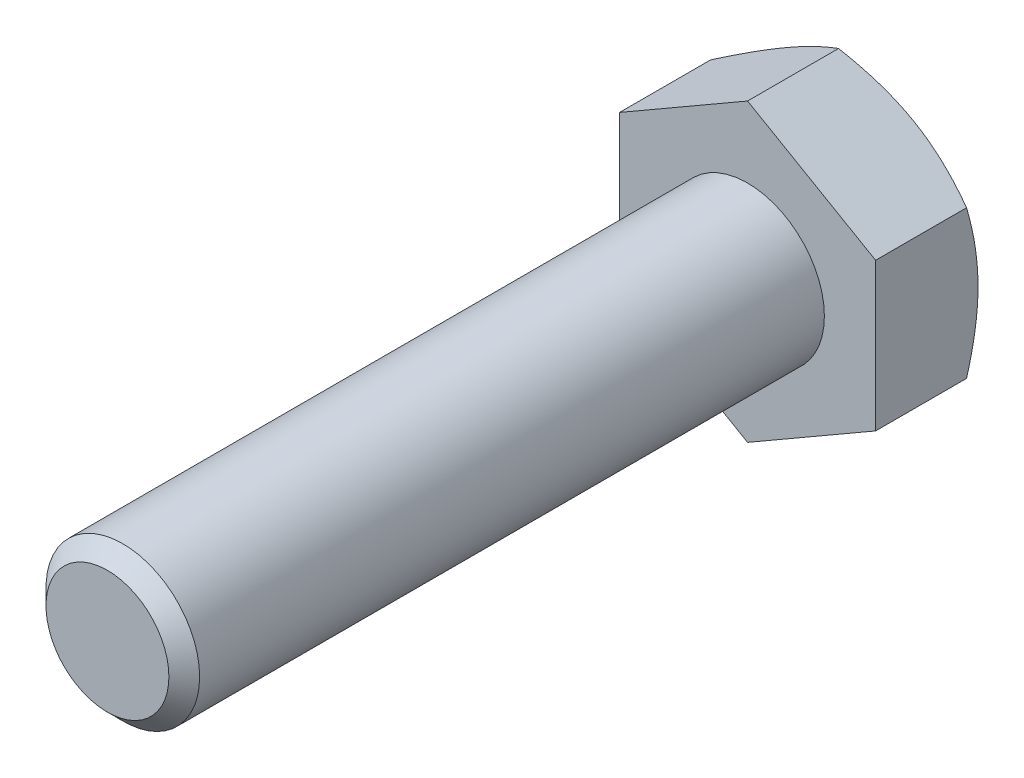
ISO-10303-21;
HEADER;
FILE_DESCRIPTION(('STEP AP214'),'2;1');
FILE_NAME('part.step','',(''),(''),'','','');
FILE_SCHEMA(('AUTOMOTIVE_DESIGN { 1 0 10303 214 1 1 1 1 }'));
ENDSEC;
DATA;
#1=APPLICATION_CONTEXT('core data for automotive mechanical design processes');
#2=APPLICATION_PROTOCOL_DEFINITION('international standard','automotive_design',2000,#1);
#3=PRODUCT_CONTEXT('',#1,'mechanical');
#4=PRODUCT('Part','Part','',(#3));
#5=PRODUCT_RELATED_PRODUCT_CATEGORY('part','',(#4));
#6=PRODUCT_DEFINITION_FORMATION('','',#4);
#7=PRODUCT_DEFINITION_CONTEXT('part definition',#1,'design');
#8=PRODUCT_DEFINITION('design','',#6,#7);
#9=PRODUCT_DEFINITION_SHAPE('','',#8);
#10=(LENGTH_UNIT() NAMED_UNIT(*) SI_UNIT(.MILLI.,.METRE.));
#11=(NAMED_UNIT(*) PLANE_ANGLE_UNIT() SI_UNIT($,.RADIAN.));
#12=(NAMED_UNIT(*) SI_UNIT($,.STERADIAN.) SOLID_ANGLE_UNIT());
#13=UNCERTAINTY_MEASURE_WITH_UNIT(LENGTH_MEASURE(1.E-05),#10,'distance_accuracy_value','');
#14=(GEOMETRIC_REPRESENTATION_CONTEXT(3) GLOBAL_UNCERTAINTY_ASSIGNED_CONTEXT((#13)) GLOBAL_UNIT_ASSIGNED_CONTEXT((#10,
#11,#12)) REPRESENTATION_CONTEXT('',''));
#15=CARTESIAN_POINT('',(0.,0.,0.));
#16=DIRECTION('',(0.,0.,1.));
#17=DIRECTION('',(1.,0.,0.));
#18=AXIS2_PLACEMENT_3D('',#15,#16,#17);
#19=CARTESIAN_POINT('',(0.,0.,25.));
#20=DIRECTION('',(0.,0.,1.));
#21=DIRECTION('',(1.,0.,0.));
#22=AXIS2_PLACEMENT_3D('',#19,#20,#21);
#23=PLANE('',#22);
#24=CARTESIAN_POINT('',(0.,0.,25.));
#25=DIRECTION('',(0.,0.,1.));
#26=DIRECTION('',(1.,0.,0.));
#27=AXIS2_PLACEMENT_3D('',#24,#25,#26);
#28=CIRCLE('',#27,2.4);
#29=CARTESIAN_POINT('',(2.40000000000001,0.,25.));
#30=VERTEX_POINT('',#29);
#31=EDGE_CURVE('E206',#30,#30,#28,.T.);
#32=ORIENTED_EDGE('',*,*,#31,.T.);
#33=EDGE_LOOP('',(#32));
#34=FACE_BOUND('',#33,.T.);
#35=ADVANCED_FACE('F32',(#34),#23,.T.);
#36=CARTESIAN_POINT('',(0.,0.,0.));
#37=DIRECTION('',(0.,0.,1.));
#38=DIRECTION('',(1.,0.,0.));
#39=AXIS2_PLACEMENT_3D('',#36,#37,#38);
#40=CYLINDRICAL_SURFACE('',#39,3.);
#41=CARTESIAN_POINT('',(0.,0.,24.4));
#42=DIRECTION('',(0.,0.,1.));
#43=DIRECTION('',(1.,0.,0.));
#44=AXIS2_PLACEMENT_3D('',#41,#42,#43);
#45=CIRCLE('',#44,3.);
#46=CARTESIAN_POINT('',(3.,0.,24.4));
#47=VERTEX_POINT('',#46);
#48=EDGE_CURVE('E208',#47,#47,#45,.F.);
#49=ORIENTED_EDGE('',*,*,#48,.T.);
#50=EDGE_LOOP('',(#49));
#51=FACE_BOUND('',#50,.T.);
#52=CARTESIAN_POINT('',(0.,0.,0.));
#53=DIRECTION('',(0.,0.,1.));
#54=DIRECTION('',(1.,0.,0.));
#55=AXIS2_PLACEMENT_3D('',#52,#53,#54);
#56=CIRCLE('',#55,3.);
#57=CARTESIAN_POINT('',(3.,0.,0.));
#58=VERTEX_POINT('',#57);
#59=EDGE_CURVE('E209',#58,#58,#56,.F.);
#60=ORIENTED_EDGE('',*,*,#59,.F.);
#61=EDGE_LOOP('',(#60));
#62=FACE_BOUND('',#61,.T.);
#63=ADVANCED_FACE('F197',(#51,#62),#40,.T.);
#64=CARTESIAN_POINT('',(0.,0.,25.));
#65=DIRECTION('',(0.,0.,-1.));
#66=DIRECTION('',(-1.,0.,0.));
#67=AXIS2_PLACEMENT_3D('',#64,#65,#66);
#68=CONICAL_SURFACE('',#67,2.4,0.785398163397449);
#69=ORIENTED_EDGE('',*,*,#48,.F.);
#70=EDGE_LOOP('',(#69));
#71=FACE_BOUND('',#70,.T.);
#72=ORIENTED_EDGE('',*,*,#31,.F.);
#73=EDGE_LOOP('',(#72));
#74=FACE_BOUND('',#73,.T.);
#75=ADVANCED_FACE('F202',(#71,#74),#68,.T.);
#76=CARTESIAN_POINT('',(0.,5.77350269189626,-4.));
#77=DIRECTION('',(0.499999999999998,0.86602540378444,0.));
#78=DIRECTION('',(-0.86602540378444,0.499999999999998,0.));
#79=AXIS2_PLACEMENT_3D('',#76,#77,#78);
#80=PLANE('',#79);
#81=CARTESIAN_POINT('',(-0.000200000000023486,5.7736181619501,-3.55335134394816));
#82=CARTESIAN_POINT('',(0.219534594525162,5.64675433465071,-3.62661343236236));
#83=CARTESIAN_POINT('',(0.441148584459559,5.5188054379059,-3.6932486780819));
#84=CARTESIAN_POINT('',(0.888213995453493,5.26069210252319,-3.80956100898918));
#85=CARTESIAN_POINT('',(1.11367335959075,5.13052307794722,-3.85919695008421));
#86=CARTESIAN_POINT('',(1.56183230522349,4.87177839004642,-3.9364489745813));
#87=CARTESIAN_POINT('',(1.78446209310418,4.74324302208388,-3.96457962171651));
#88=CARTESIAN_POINT('',(2.11918990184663,4.54998783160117,-3.98980507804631));
#89=CARTESIAN_POINT('',(2.23084219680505,4.48552534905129,-3.99538654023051));
#90=CARTESIAN_POINT('',(2.45424997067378,4.35654081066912,-4.00079778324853));
#91=CARTESIAN_POINT('',(2.5660054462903,4.29201875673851,-4.00062774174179));
#92=CARTESIAN_POINT('',(2.87218423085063,4.11524635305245,-3.99224636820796));
#93=CARTESIAN_POINT('',(3.0665060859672,4.00305457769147,-3.97817022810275));
#94=CARTESIAN_POINT('',(3.4538601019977,3.77941563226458,-3.93353474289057));
#95=CARTESIAN_POINT('',(3.64689090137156,3.66796924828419,-3.90296013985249));
#96=CARTESIAN_POINT('',(4.03502534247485,3.44387972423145,-3.82653150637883));
#97=CARTESIAN_POINT('',(4.23007999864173,3.33126486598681,-3.78035362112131));
#98=CARTESIAN_POINT('',(4.61728034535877,3.10771464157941,-3.67554820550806));
#99=CARTESIAN_POINT('',(4.80943099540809,2.99677641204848,-3.61694529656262));
#100=CARTESIAN_POINT('',(5.0002,2.8866358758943,-3.55335134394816));
#101=B_SPLINE_CURVE_WITH_KNOTS('',3,(#81,#82,#83,#84,#85,#86,#87,#88,#89,#90,#91,#92,#93,#94,
#95,#96,#97,#98,#99,#100),.UNSPECIFIED.,.F.,.F.,(4,2,2,2,2,2,2,2,2,4),(0.,0.792555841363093,
1.58701660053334,2.36181537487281,2.74884076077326,3.13585419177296,3.8096236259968,
4.48401723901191,5.1733688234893,5.86136694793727),.UNSPECIFIED.);
#102=CARTESIAN_POINT('',(0.,5.77350269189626,-3.55341801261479));
#103=VERTEX_POINT('',#102);
#104=CARTESIAN_POINT('',(2.49999999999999,4.3301270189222,-4.));
#105=VERTEX_POINT('',#104);
#106=EDGE_CURVE('E242',#103,#105,#101,.T.);
#107=ORIENTED_EDGE('',*,*,#106,.F.);
#108=DIRECTION('',(0.,0.,1.));
#109=VECTOR('',#108,1.);
#110=CARTESIAN_POINT('',(0.,5.77350269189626,-4.));
#111=LINE('',#110,#109);
#112=CARTESIAN_POINT('',(0.,5.77350269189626,0.));
#113=VERTEX_POINT('',#112);
#114=EDGE_CURVE('E216',#103,#113,#111,.T.);
#115=ORIENTED_EDGE('',*,*,#114,.T.);
#116=DIRECTION('',(-0.86602540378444,0.499999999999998,0.));
#117=VECTOR('',#116,1.);
#118=CARTESIAN_POINT('',(0.,5.77350269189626,0.));
#119=LINE('',#118,#117);
#120=CARTESIAN_POINT('',(5.,2.88675134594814,0.));
#121=VERTEX_POINT('',#120);
#122=EDGE_CURVE('E240',#121,#113,#119,.T.);
#123=ORIENTED_EDGE('',*,*,#122,.F.);
#124=DIRECTION('',(0.,0.,1.));
#125=VECTOR('',#124,1.);
#126=CARTESIAN_POINT('',(5.,2.88675134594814,-4.));
#127=LINE('',#126,#125);
#128=CARTESIAN_POINT('',(5.,2.88675134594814,-3.55341801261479));
#129=VERTEX_POINT('',#128);
#130=EDGE_CURVE('E213',#129,#121,#127,.T.);
#131=ORIENTED_EDGE('',*,*,#130,.F.);
#132=EDGE_CURVE('E172',#105,#129,#101,.T.);
#133=ORIENTED_EDGE('',*,*,#132,.F.);
#134=EDGE_LOOP('',(#107,#115,#123,#131,#133));
#135=FACE_BOUND('',#134,.T.);
#136=ADVANCED_FACE('F182',(#135),#80,.T.);
#137=CARTESIAN_POINT('',(5.,-2.88675134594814,-4.));
#138=DIRECTION('',(1.,0.,0.));
#139=DIRECTION('',(0.,0.,-1.));
#140=AXIS2_PLACEMENT_3D('',#137,#138,#139);
#141=PLANE('',#140);
#142=CARTESIAN_POINT('',(5.,-7.87365701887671,-1.5017575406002));
#143=CARTESIAN_POINT('',(5.,-7.65421637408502,-1.60868091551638));
#144=CARTESIAN_POINT('',(5.,-7.43428458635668,-1.71461296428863));
#145=CARTESIAN_POINT('',(5.,-6.99317792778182,-1.92393906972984));
#146=CARTESIAN_POINT('',(5.,-6.77200287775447,-2.02733274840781));
#147=CARTESIAN_POINT('',(5.,-6.32706593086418,-2.23152152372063));
#148=CARTESIAN_POINT('',(5.,-6.10329657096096,-2.3323004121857));
#149=CARTESIAN_POINT('',(5.,-5.65401907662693,-2.52988978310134));
#150=CARTESIAN_POINT('',(5.,-5.42851102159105,-2.62670044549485));
#151=CARTESIAN_POINT('',(5.,-4.96773019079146,-2.81850105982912));
#152=CARTESIAN_POINT('',(5.,-4.73238523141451,-2.91331851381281));
#153=CARTESIAN_POINT('',(5.,-4.2589865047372,-3.09606229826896));
#154=CARTESIAN_POINT('',(5.,-4.02093244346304,-3.18398787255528));
#155=CARTESIAN_POINT('',(5.,-3.54214478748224,-3.35072723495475));
#156=CARTESIAN_POINT('',(5.,-3.301417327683,-3.42955846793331));
#157=CARTESIAN_POINT('',(5.,-2.81651125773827,-3.57565910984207));
#158=CARTESIAN_POINT('',(5.,-2.57233372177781,-3.64293203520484));
#159=CARTESIAN_POINT('',(5.,-2.08173956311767,-3.7624103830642));
#160=CARTESIAN_POINT('',(5.,-1.83534384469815,-3.81470009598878));
#161=CARTESIAN_POINT('',(5.,-1.33936717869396,-3.90133365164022));
#162=CARTESIAN_POINT('',(5.,-1.08978658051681,-3.93567944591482));
#163=CARTESIAN_POINT('',(5.,-0.591994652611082,-3.98324171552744));
#164=CARTESIAN_POINT('',(5.,-0.34381084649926,-3.99673913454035));
#165=CARTESIAN_POINT('',(5.,0.152820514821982,-4.00220795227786));
#166=CARTESIAN_POINT('',(5.,0.401268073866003,-3.99417903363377));
#167=CARTESIAN_POINT('',(5.,0.819539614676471,-3.96311999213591));
#168=CARTESIAN_POINT('',(5.,0.989794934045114,-3.94552930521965));
#169=CARTESIAN_POINT('',(5.,1.32912938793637,-3.90127081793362));
#170=CARTESIAN_POINT('',(5.,1.49820837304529,-3.87460188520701));
#171=CARTESIAN_POINT('',(5.,2.00341173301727,-3.78237229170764));
#172=CARTESIAN_POINT('',(5.,2.33733597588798,-3.7046029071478));
#173=CARTESIAN_POINT('',(5.,2.83691487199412,-3.56883106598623));
#174=CARTESIAN_POINT('',(5.,3.00513229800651,-3.51971360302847));
#175=CARTESIAN_POINT('',(5.,3.33993504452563,-3.41615110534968));
#176=CARTESIAN_POINT('',(5.,3.50652035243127,-3.36170602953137));
#177=CARTESIAN_POINT('',(5.,3.83810926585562,-3.24838071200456));
#178=CARTESIAN_POINT('',(5.,4.00311330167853,-3.18950171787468));
#179=CARTESIAN_POINT('',(5.,4.33173746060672,-3.06802383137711));
#180=CARTESIAN_POINT('',(5.,4.49535761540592,-3.00542502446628));
#181=CARTESIAN_POINT('',(5.,4.9359829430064,-2.83201950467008));
#182=CARTESIAN_POINT('',(5.,5.21182602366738,-2.71826266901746));
#183=CARTESIAN_POINT('',(5.,5.76066658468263,-2.48405585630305));
#184=CARTESIAN_POINT('',(5.,6.03366374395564,-2.36360513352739));
#185=CARTESIAN_POINT('',(5.,6.57746623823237,-2.11759609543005));
#186=CARTESIAN_POINT('',(5.,6.84827068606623,-1.99203582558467));
#187=CARTESIAN_POINT('',(5.,7.38802449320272,-1.73703058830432));
#188=CARTESIAN_POINT('',(5.,7.65697392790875,-1.60758577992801));
#189=CARTESIAN_POINT('',(5.,8.19381940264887,-1.34544789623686));
#190=CARTESIAN_POINT('',(5.,8.46171304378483,-1.21274991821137));
#191=CARTESIAN_POINT('',(5.,8.99628800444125,-0.944933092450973));
#192=CARTESIAN_POINT('',(5.,9.26296931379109,-0.809814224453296));
#193=CARTESIAN_POINT('',(5.,10.0614145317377,-0.401627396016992));
#194=CARTESIAN_POINT('',(5.,10.5917004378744,-0.125669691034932));
#195=CARTESIAN_POINT('',(5.,11.5934978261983,0.401869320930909));
#196=CARTESIAN_POINT('',(5.,12.0652823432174,0.652934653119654));
#197=CARTESIAN_POINT('',(5.,13.0072652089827,1.1580917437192));
#198=CARTESIAN_POINT('',(5.,13.4774634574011,1.41218368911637));
#199=CARTESIAN_POINT('',(5.,14.4150598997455,1.92174727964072));
#200=CARTESIAN_POINT('',(5.,14.8824621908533,2.17721139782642));
#201=CARTESIAN_POINT('',(5.,15.8162766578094,2.68985606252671));
#202=CARTESIAN_POINT('',(5.,16.2826889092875,2.94703647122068));
#203=CARTESIAN_POINT('',(5.,16.7487534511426,3.20484156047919));
#204=B_SPLINE_CURVE_WITH_KNOTS('',3,(#142,#143,#144,#145,#146,#147,#148,#149,#150,#151,#152,
#153,#154,#155,#156,#157,#158,#159,#160,#161,#162,#163,#164,#165,#166,#167,#168,#169,#170,#171,
#172,#173,#174,#175,#176,#177,#178,#179,#180,#181,#182,#183,#184,#185,#186,#187,#188,#189,#190,
#191,#192,#193,#194,#195,#196,#197,#198,#199,#200,#201,#202,#203),.UNSPECIFIED.,.F.,.F.,(4,2,2,
2,2,2,2,2,2,2,2,2,2,2,2,2,2,2,2,2,2,2,2,2,2,2,2,2,2,2,4),(0.,0.732320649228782,1.46474969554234,
2.20096737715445,2.93715163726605,3.69825037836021,4.45943251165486,5.2191293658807,
5.97859468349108,6.73369963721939,7.48872245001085,8.2334792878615,8.97824710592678,
9.49148539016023,10.0047877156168,11.0318914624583,11.5575684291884,12.0832494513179,
12.6087831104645,13.1343047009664,14.0293094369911,14.9244140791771,15.819864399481,
16.7152781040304,17.612136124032,18.5090016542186,20.3023290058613,21.9056050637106,
23.5089806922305,25.106957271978,26.7048070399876),.UNSPECIFIED.);
#205=CARTESIAN_POINT('',(5.,0.,-4.));
#206=VERTEX_POINT('',#205);
#207=EDGE_CURVE('E170',#129,#206,#204,.F.);
#208=ORIENTED_EDGE('',*,*,#207,.F.);
#209=ORIENTED_EDGE('',*,*,#130,.T.);
#210=DIRECTION('',(0.,1.,0.));
#211=VECTOR('',#210,1.);
#212=CARTESIAN_POINT('',(5.,-2.88675134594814,0.));
#213=LINE('',#212,#211);
#214=CARTESIAN_POINT('',(5.,-2.88675134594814,0.));
#215=VERTEX_POINT('',#214);
#216=EDGE_CURVE('E218',#215,#121,#213,.T.);
#217=ORIENTED_EDGE('',*,*,#216,.F.);
#218=DIRECTION('',(0.,0.,1.));
#219=VECTOR('',#218,1.);
#220=CARTESIAN_POINT('',(5.,-2.88675134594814,-4.));
#221=LINE('',#220,#219);
#222=CARTESIAN_POINT('',(5.,-2.88675134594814,-3.55341801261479));
#223=VERTEX_POINT('',#222);
#224=EDGE_CURVE('E224',#223,#215,#221,.T.);
#225=ORIENTED_EDGE('',*,*,#224,.F.);
#226=EDGE_CURVE('E165',#206,#223,#204,.F.);
#227=ORIENTED_EDGE('',*,*,#226,.F.);
#228=EDGE_LOOP('',(#208,#209,#217,#225,#227));
#229=FACE_BOUND('',#228,.T.);
#230=ADVANCED_FACE('F178',(#229),#141,.T.);
#231=CARTESIAN_POINT('',(0.,-5.77350269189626,-4.));
#232=DIRECTION('',(0.499999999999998,-0.86602540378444,0.));
#233=DIRECTION('',(0.86602540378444,0.499999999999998,0.));
#234=AXIS2_PLACEMENT_3D('',#231,#232,#233);
#235=PLANE('',#234);
#236=CARTESIAN_POINT('',(5.0002,-2.8866358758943,-3.55335134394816));
#237=CARTESIAN_POINT('',(4.78046540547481,-3.01349970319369,-3.62661343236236));
#238=CARTESIAN_POINT('',(4.55885141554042,-3.1414485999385,-3.6932486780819));
#239=CARTESIAN_POINT('',(4.11178600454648,-3.39956193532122,-3.80956100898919));
#240=CARTESIAN_POINT('',(3.88632664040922,-3.52973095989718,-3.85919695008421));
#241=CARTESIAN_POINT('',(3.43816769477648,-3.78847564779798,-3.9364489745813));
#242=CARTESIAN_POINT('',(3.2155379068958,-3.91701101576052,-3.96457962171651));
#243=CARTESIAN_POINT('',(2.88081009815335,-4.11026620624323,-3.98980507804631));
#244=CARTESIAN_POINT('',(2.76915780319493,-4.17472868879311,-3.99538654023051));
#245=CARTESIAN_POINT('',(2.54575002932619,-4.30371322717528,-4.00079778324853));
#246=CARTESIAN_POINT('',(2.43399455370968,-4.36823528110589,-4.00062774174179));
#247=CARTESIAN_POINT('',(2.12781576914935,-4.54500768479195,-3.99224636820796));
#248=CARTESIAN_POINT('',(1.93349391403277,-4.65719946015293,-3.97817022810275));
#249=CARTESIAN_POINT('',(1.54613989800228,-4.88083840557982,-3.93353474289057));
#250=CARTESIAN_POINT('',(1.35310909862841,-4.99228478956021,-3.90296013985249));
#251=CARTESIAN_POINT('',(0.964974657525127,-5.21637431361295,-3.82653150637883));
#252=CARTESIAN_POINT('',(0.769920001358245,-5.32898917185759,-3.78035362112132));
#253=CARTESIAN_POINT('',(0.38271965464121,-5.55253939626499,-3.67554820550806));
#254=CARTESIAN_POINT('',(0.190569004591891,-5.66347762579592,-3.61694529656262));
#255=CARTESIAN_POINT('',(-0.000200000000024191,-5.7736181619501,-3.55335134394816));
#256=B_SPLINE_CURVE_WITH_KNOTS('',3,(#236,#237,#238,#239,#240,#241,#242,#243,#244,#245,#246,
#247,#248,#249,#250,#251,#252,#253,#254,#255),.UNSPECIFIED.,.F.,.F.,(4,2,2,2,2,2,2,2,2,4),(0.,
0.792555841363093,1.58701660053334,2.36181537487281,2.74884076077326,3.13585419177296,
3.8096236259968,4.48401723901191,5.1733688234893,5.86136694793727),.UNSPECIFIED.);
#257=CARTESIAN_POINT('',(2.49999999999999,-4.3301270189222,-4.));
#258=VERTEX_POINT('',#257);
#259=EDGE_CURVE('E171',#223,#258,#256,.T.);
#260=ORIENTED_EDGE('',*,*,#259,.F.);
#261=ORIENTED_EDGE('',*,*,#224,.T.);
#262=DIRECTION('',(0.86602540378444,0.499999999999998,0.));
#263=VECTOR('',#262,1.);
#264=CARTESIAN_POINT('',(0.,-5.77350269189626,0.));
#265=LINE('',#264,#263);
#266=CARTESIAN_POINT('',(0.,-5.77350269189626,0.));
#267=VERTEX_POINT('',#266);
#268=EDGE_CURVE('E229',#267,#215,#265,.T.);
#269=ORIENTED_EDGE('',*,*,#268,.F.);
#270=DIRECTION('',(0.,0.,1.));
#271=VECTOR('',#270,1.);
#272=CARTESIAN_POINT('',(0.,-5.77350269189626,-4.));
#273=LINE('',#272,#271);
#274=CARTESIAN_POINT('',(0.,-5.77350269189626,-3.55341801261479));
#275=VERTEX_POINT('',#274);
#276=EDGE_CURVE('E222',#275,#267,#273,.T.);
#277=ORIENTED_EDGE('',*,*,#276,.F.);
#278=EDGE_CURVE('E159',#258,#275,#256,.T.);
#279=ORIENTED_EDGE('',*,*,#278,.F.);
#280=EDGE_LOOP('',(#260,#261,#269,#277,#279));
#281=FACE_BOUND('',#280,.T.);
#282=ADVANCED_FACE('F181',(#281),#235,.T.);
#283=CARTESIAN_POINT('',(0.,-5.77350269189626,-4.));
#284=DIRECTION('',(-0.500000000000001,-0.866025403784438,0.));
#285=DIRECTION('',(0.866025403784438,-0.500000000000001,0.));
#286=AXIS2_PLACEMENT_3D('',#283,#284,#285);
#287=PLANE('',#286);
#288=CARTESIAN_POINT('',(0.000199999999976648,-5.7736181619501,-3.55335134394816));
#289=CARTESIAN_POINT('',(-0.219534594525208,-5.64675433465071,-3.62661343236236));
#290=CARTESIAN_POINT('',(-0.441148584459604,-5.5188054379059,-3.6932486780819));
#291=CARTESIAN_POINT('',(-0.888213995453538,-5.26069210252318,-3.80956100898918));
#292=CARTESIAN_POINT('',(-1.1136733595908,-5.13052307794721,-3.8591969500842));
#293=CARTESIAN_POINT('',(-1.56183230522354,-4.87177839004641,-3.9364489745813));
#294=CARTESIAN_POINT('',(-1.78446209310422,-4.74324302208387,-3.9645796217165));
#295=CARTESIAN_POINT('',(-2.11918990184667,-4.54998783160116,-3.98980507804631));
#296=CARTESIAN_POINT('',(-2.23084219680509,-4.48552534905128,-3.99538654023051));
#297=CARTESIAN_POINT('',(-2.45424997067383,-4.35654081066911,-4.00079778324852));
#298=CARTESIAN_POINT('',(-2.56600544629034,-4.2920187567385,-4.00062774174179));
#299=CARTESIAN_POINT('',(-2.87218423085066,-4.11524635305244,-3.99224636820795));
#300=CARTESIAN_POINT('',(-3.06650608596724,-4.00305457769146,-3.97817022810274));
#301=CARTESIAN_POINT('',(-3.45386010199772,-3.77941563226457,-3.93353474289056));
#302=CARTESIAN_POINT('',(-3.64689090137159,-3.66796924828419,-3.90296013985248));
#303=CARTESIAN_POINT('',(-4.03502534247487,-3.44387972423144,-3.82653150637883));
#304=CARTESIAN_POINT('',(-4.23007999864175,-3.3312648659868,-3.78035362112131));
#305=CARTESIAN_POINT('',(-4.61728034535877,-3.10771464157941,-3.67554820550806));
#306=CARTESIAN_POINT('',(-4.80943099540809,-2.99677641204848,-3.61694529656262));
#307=CARTESIAN_POINT('',(-5.0002,-2.8866358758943,-3.55335134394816));
#308=B_SPLINE_CURVE_WITH_KNOTS('',3,(#288,#289,#290,#291,#292,#293,#294,#295,#296,#297,#298,
#299,#300,#301,#302,#303,#304,#305,#306,#307),.UNSPECIFIED.,.F.,.F.,(4,2,2,2,2,2,2,2,2,4),(0.,
0.792555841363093,1.58701660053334,2.36181537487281,2.74884076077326,3.13585419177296,
3.80962362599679,4.48401723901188,5.17336882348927,5.86136694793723),.UNSPECIFIED.);
#309=CARTESIAN_POINT('',(-2.50000000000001,-4.33012701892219,-4.));
#310=VERTEX_POINT('',#309);
#311=EDGE_CURVE('E261',#275,#310,#308,.T.);
#312=ORIENTED_EDGE('',*,*,#311,.F.);
#313=ORIENTED_EDGE('',*,*,#276,.T.);
#314=DIRECTION('',(0.866025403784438,-0.500000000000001,0.));
#315=VECTOR('',#314,1.);
#316=CARTESIAN_POINT('',(0.,-5.77350269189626,0.));
#317=LINE('',#316,#315);
#318=CARTESIAN_POINT('',(-5.,-2.88675134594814,0.));
#319=VERTEX_POINT('',#318);
#320=EDGE_CURVE('E232',#319,#267,#317,.T.);
#321=ORIENTED_EDGE('',*,*,#320,.F.);
#322=DIRECTION('',(0.,0.,1.));
#323=VECTOR('',#322,1.);
#324=CARTESIAN_POINT('',(-5.,-2.88675134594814,-4.));
#325=LINE('',#324,#323);
#326=CARTESIAN_POINT('',(-5.,-2.88675134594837,-3.55341801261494));
#327=VERTEX_POINT('',#326);
#328=EDGE_CURVE('E220',#327,#319,#325,.T.);
#329=ORIENTED_EDGE('',*,*,#328,.F.);
#330=EDGE_CURVE('E108',#310,#327,#308,.T.);
#331=ORIENTED_EDGE('',*,*,#330,.F.);
#332=EDGE_LOOP('',(#312,#313,#321,#329,#331));
#333=FACE_BOUND('',#332,.T.);
#334=ADVANCED_FACE('F186',(#333),#287,.T.);
#335=CARTESIAN_POINT('',(-5.,-2.88675134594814,-4.));
#336=DIRECTION('',(-1.,0.,0.));
#337=DIRECTION('',(0.,0.,1.));
#338=AXIS2_PLACEMENT_3D('',#335,#336,#337);
#339=PLANE('',#338);
#340=CARTESIAN_POINT('',(-5.,-7.8736570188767,-1.5017575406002));
#341=CARTESIAN_POINT('',(-5.,-7.65421637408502,-1.60868091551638));
#342=CARTESIAN_POINT('',(-5.,-7.43428458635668,-1.71461296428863));
#343=CARTESIAN_POINT('',(-5.,-6.99317792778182,-1.92393906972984));
#344=CARTESIAN_POINT('',(-5.,-6.77200287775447,-2.02733274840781));
#345=CARTESIAN_POINT('',(-5.,-6.32706593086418,-2.23152152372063));
#346=CARTESIAN_POINT('',(-5.,-6.10329657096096,-2.3323004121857));
#347=CARTESIAN_POINT('',(-5.,-5.65401907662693,-2.52988978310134));
#348=CARTESIAN_POINT('',(-5.,-5.42851102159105,-2.62670044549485));
#349=CARTESIAN_POINT('',(-5.,-4.96773019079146,-2.81850105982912));
#350=CARTESIAN_POINT('',(-5.,-4.73238523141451,-2.91331851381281));
#351=CARTESIAN_POINT('',(-5.,-4.2589865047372,-3.09606229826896));
#352=CARTESIAN_POINT('',(-5.,-4.02093244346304,-3.18398787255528));
#353=CARTESIAN_POINT('',(-5.,-3.54214478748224,-3.35072723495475));
#354=CARTESIAN_POINT('',(-5.,-3.301417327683,-3.42955846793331));
#355=CARTESIAN_POINT('',(-5.,-2.81651125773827,-3.57565910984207));
#356=CARTESIAN_POINT('',(-5.,-2.57233372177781,-3.64293203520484));
#357=CARTESIAN_POINT('',(-5.,-2.08173956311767,-3.7624103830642));
#358=CARTESIAN_POINT('',(-5.,-1.83534384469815,-3.81470009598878));
#359=CARTESIAN_POINT('',(-5.,-1.33936717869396,-3.90133365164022));
#360=CARTESIAN_POINT('',(-5.,-1.08978658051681,-3.93567944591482));
#361=CARTESIAN_POINT('',(-5.,-0.591994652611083,-3.98324171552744));
#362=CARTESIAN_POINT('',(-5.,-0.343810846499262,-3.99673913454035));
#363=CARTESIAN_POINT('',(-5.,0.152820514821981,-4.00220795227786));
#364=CARTESIAN_POINT('',(-5.,0.401268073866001,-3.99417903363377));
#365=CARTESIAN_POINT('',(-5.,0.81953961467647,-3.96311999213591));
#366=CARTESIAN_POINT('',(-5.,0.989794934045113,-3.94552930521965));
#367=CARTESIAN_POINT('',(-5.,1.32912938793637,-3.90127081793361));
#368=CARTESIAN_POINT('',(-5.,1.49820837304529,-3.87460188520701));
#369=CARTESIAN_POINT('',(-5.,2.00341173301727,-3.78237229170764));
#370=CARTESIAN_POINT('',(-5.,2.33733597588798,-3.7046029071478));
#371=CARTESIAN_POINT('',(-5.,2.83691487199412,-3.56883106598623));
#372=CARTESIAN_POINT('',(-5.,3.00513229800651,-3.51971360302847));
#373=CARTESIAN_POINT('',(-5.,3.33993504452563,-3.41615110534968));
#374=CARTESIAN_POINT('',(-5.,3.50652035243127,-3.36170602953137));
#375=CARTESIAN_POINT('',(-5.,3.83810926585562,-3.24838071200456));
#376=CARTESIAN_POINT('',(-5.,4.00311330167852,-3.18950171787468));
#377=CARTESIAN_POINT('',(-5.,4.33173746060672,-3.06802383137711));
#378=CARTESIAN_POINT('',(-5.,4.49535761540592,-3.00542502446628));
#379=CARTESIAN_POINT('',(-5.,4.9359829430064,-2.83201950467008));
#380=CARTESIAN_POINT('',(-5.,5.21182602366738,-2.71826266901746));
#381=CARTESIAN_POINT('',(-5.,5.76066658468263,-2.48405585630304));
#382=CARTESIAN_POINT('',(-5.,6.03366374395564,-2.36360513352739));
#383=CARTESIAN_POINT('',(-5.,6.57746623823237,-2.11759609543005));
#384=CARTESIAN_POINT('',(-5.,6.84827068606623,-1.99203582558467));
#385=CARTESIAN_POINT('',(-5.,7.38802449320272,-1.73703058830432));
#386=CARTESIAN_POINT('',(-5.,7.65697392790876,-1.60758577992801));
#387=CARTESIAN_POINT('',(-5.,8.19381940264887,-1.34544789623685));
#388=CARTESIAN_POINT('',(-5.,8.46171304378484,-1.21274991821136));
#389=CARTESIAN_POINT('',(-5.,8.99628800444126,-0.944933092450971));
#390=CARTESIAN_POINT('',(-5.,9.26296931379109,-0.809814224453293));
#391=CARTESIAN_POINT('',(-5.,10.0614145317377,-0.401627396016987));
#392=CARTESIAN_POINT('',(-5.,10.5917004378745,-0.125669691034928));
#393=CARTESIAN_POINT('',(-5.,11.5934978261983,0.401869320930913));
#394=CARTESIAN_POINT('',(-5.,12.0652823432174,0.652934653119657));
#395=CARTESIAN_POINT('',(-5.,13.0072652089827,1.15809174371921));
#396=CARTESIAN_POINT('',(-5.,13.4774634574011,1.41218368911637));
#397=CARTESIAN_POINT('',(-5.,14.4150598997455,1.92174727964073));
#398=CARTESIAN_POINT('',(-5.,14.8824621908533,2.17721139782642));
#399=CARTESIAN_POINT('',(-5.,15.8162766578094,2.68985606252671));
#400=CARTESIAN_POINT('',(-5.,16.2826889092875,2.94703647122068));
#401=CARTESIAN_POINT('',(-5.,16.7487534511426,3.20484156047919));
#402=B_SPLINE_CURVE_WITH_KNOTS('',3,(#340,#341,#342,#343,#344,#345,#346,#347,#348,#349,#350,
#351,#352,#353,#354,#355,#356,#357,#358,#359,#360,#361,#362,#363,#364,#365,#366,#367,#368,#369,
#370,#371,#372,#373,#374,#375,#376,#377,#378,#379,#380,#381,#382,#383,#384,#385,#386,#387,#388,
#389,#390,#391,#392,#393,#394,#395,#396,#397,#398,#399,#400,#401),.UNSPECIFIED.,.F.,.F.,(4,2,2,
2,2,2,2,2,2,2,2,2,2,2,2,2,2,2,2,2,2,2,2,2,2,2,2,2,2,2,4),(0.,0.732320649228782,1.46474969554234,
2.20096737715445,2.93715163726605,3.69825037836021,4.45943251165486,5.2191293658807,
5.97859468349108,6.73369963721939,7.48872245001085,8.2334792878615,8.97824710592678,
9.49148539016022,10.0047877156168,11.0318914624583,11.5575684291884,12.0832494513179,
12.6087831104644,13.1343047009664,14.0293094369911,14.9244140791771,15.819864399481,
16.7152781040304,17.612136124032,18.5090016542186,20.3023290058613,21.9056050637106,
23.5089806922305,25.106957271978,26.7048070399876),.UNSPECIFIED.);
#403=CARTESIAN_POINT('',(-5.,0.,-4.));
#404=VERTEX_POINT('',#403);
#405=EDGE_CURVE('E103',#327,#404,#402,.T.);
#406=ORIENTED_EDGE('',*,*,#405,.F.);
#407=ORIENTED_EDGE('',*,*,#328,.T.);
#408=DIRECTION('',(0.,-1.,0.));
#409=VECTOR('',#408,1.);
#410=CARTESIAN_POINT('',(-5.,-2.88675134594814,0.));
#411=LINE('',#410,#409);
#412=CARTESIAN_POINT('',(-5.,2.88675134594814,0.));
#413=VERTEX_POINT('',#412);
#414=EDGE_CURVE('E235',#413,#319,#411,.T.);
#415=ORIENTED_EDGE('',*,*,#414,.F.);
#416=DIRECTION('',(0.,0.,1.));
#417=VECTOR('',#416,1.);
#418=CARTESIAN_POINT('',(-5.,2.88675134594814,-4.));
#419=LINE('',#418,#417);
#420=CARTESIAN_POINT('',(-5.,2.88675134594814,-3.55341801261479));
#421=VERTEX_POINT('',#420);
#422=EDGE_CURVE('E129',#421,#413,#419,.T.);
#423=ORIENTED_EDGE('',*,*,#422,.F.);
#424=EDGE_CURVE('E112',#404,#421,#402,.T.);
#425=ORIENTED_EDGE('',*,*,#424,.F.);
#426=EDGE_LOOP('',(#406,#407,#415,#423,#425));
#427=FACE_BOUND('',#426,.T.);
#428=ADVANCED_FACE('F127',(#427),#339,.T.);
#429=CARTESIAN_POINT('',(-5.,2.88675134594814,-4.));
#430=DIRECTION('',(-0.500000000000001,0.866025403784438,0.));
#431=DIRECTION('',(-0.866025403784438,-0.500000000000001,0.));
#432=AXIS2_PLACEMENT_3D('',#429,#430,#431);
#433=PLANE('',#432);
#434=CARTESIAN_POINT('',(-5.0002,2.8866358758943,-3.55335134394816));
#435=CARTESIAN_POINT('',(-4.78046540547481,3.01349970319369,-3.62661343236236));
#436=CARTESIAN_POINT('',(-4.55885141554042,3.1414485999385,-3.6932486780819));
#437=CARTESIAN_POINT('',(-4.11178600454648,3.39956193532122,-3.80956100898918));
#438=CARTESIAN_POINT('',(-3.88632664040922,3.52973095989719,-3.8591969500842));
#439=CARTESIAN_POINT('',(-3.43816769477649,3.78847564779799,-3.9364489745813));
#440=CARTESIAN_POINT('',(-3.2155379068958,3.91701101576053,-3.9645796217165));
#441=CARTESIAN_POINT('',(-2.88081009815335,4.11026620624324,-3.98980507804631));
#442=CARTESIAN_POINT('',(-2.76915780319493,4.17472868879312,-3.99538654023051));
#443=CARTESIAN_POINT('',(-2.5457500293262,4.30371322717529,-4.00079778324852));
#444=CARTESIAN_POINT('',(-2.43399455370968,4.3682352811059,-4.00062774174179));
#445=CARTESIAN_POINT('',(-2.12781576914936,4.54500768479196,-3.99224636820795));
#446=CARTESIAN_POINT('',(-1.93349391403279,4.65719946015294,-3.97817022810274));
#447=CARTESIAN_POINT('',(-1.5461398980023,4.88083840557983,-3.93353474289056));
#448=CARTESIAN_POINT('',(-1.35310909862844,4.99228478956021,-3.90296013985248));
#449=CARTESIAN_POINT('',(-0.964974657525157,5.21637431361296,-3.82653150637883));
#450=CARTESIAN_POINT('',(-0.769920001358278,5.32898917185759,-3.78035362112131));
#451=CARTESIAN_POINT('',(-0.38271965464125,5.55253939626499,-3.67554820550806));
#452=CARTESIAN_POINT('',(-0.190569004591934,5.66347762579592,-3.61694529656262));
#453=CARTESIAN_POINT('',(0.00019999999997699,5.7736181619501,-3.55335134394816));
#454=B_SPLINE_CURVE_WITH_KNOTS('',3,(#434,#435,#436,#437,#438,#439,#440,#441,#442,#443,#444,
#445,#446,#447,#448,#449,#450,#451,#452,#453),.UNSPECIFIED.,.F.,.F.,(4,2,2,2,2,2,2,2,2,4),(0.,
0.792555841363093,1.58701660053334,2.36181537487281,2.74884076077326,3.13585419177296,
3.80962362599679,4.48401723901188,5.17336882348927,5.86136694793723),.UNSPECIFIED.);
#455=CARTESIAN_POINT('',(-2.50000000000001,4.3301270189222,-4.));
#456=VERTEX_POINT('',#455);
#457=EDGE_CURVE('E118',#421,#456,#454,.T.);
#458=ORIENTED_EDGE('',*,*,#457,.F.);
#459=ORIENTED_EDGE('',*,*,#422,.T.);
#460=DIRECTION('',(-0.866025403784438,-0.500000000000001,0.));
#461=VECTOR('',#460,1.);
#462=CARTESIAN_POINT('',(-5.,2.88675134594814,0.));
#463=LINE('',#462,#461);
#464=EDGE_CURVE('E238',#113,#413,#463,.T.);
#465=ORIENTED_EDGE('',*,*,#464,.F.);
#466=ORIENTED_EDGE('',*,*,#114,.F.);
#467=EDGE_CURVE('E120',#456,#103,#454,.T.);
#468=ORIENTED_EDGE('',*,*,#467,.F.);
#469=EDGE_LOOP('',(#458,#459,#465,#466,#468));
#470=FACE_BOUND('',#469,.T.);
#471=ADVANCED_FACE('F194',(#470),#433,.T.);
#472=CARTESIAN_POINT('',(5.,2.88675134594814,0.));
#473=DIRECTION('',(0.,0.,1.));
#474=DIRECTION('',(1.,0.,0.));
#475=AXIS2_PLACEMENT_3D('',#472,#473,#474);
#476=PLANE('',#475);
#477=ORIENTED_EDGE('',*,*,#59,.T.);
#478=EDGE_LOOP('',(#477));
#479=FACE_BOUND('',#478,.T.);
#480=ORIENTED_EDGE('',*,*,#122,.T.);
#481=ORIENTED_EDGE('',*,*,#464,.T.);
#482=ORIENTED_EDGE('',*,*,#414,.T.);
#483=ORIENTED_EDGE('',*,*,#320,.T.);
#484=ORIENTED_EDGE('',*,*,#268,.T.);
#485=ORIENTED_EDGE('',*,*,#216,.T.);
#486=EDGE_LOOP('',(#480,#481,#482,#483,#484,#485));
#487=FACE_BOUND('',#486,.T.);
#488=ADVANCED_FACE('F151',(#479,#487),#476,.T.);
#489=CARTESIAN_POINT('',(0.,0.,0.));
#490=DIRECTION('',(0.,0.,1.));
#491=DIRECTION('',(1.,0.,0.));
#492=AXIS2_PLACEMENT_3D('',#489,#490,#491);
#493=CONICAL_SURFACE('',#492,11.9282032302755,1.0471975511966);
#494=ORIENTED_EDGE('',*,*,#132,.T.);
#495=ORIENTED_EDGE('',*,*,#207,.T.);
#496=CARTESIAN_POINT('',(0.,0.,-4.));
#497=DIRECTION('',(0.,0.,1.));
#498=DIRECTION('',(1.,0.,0.));
#499=AXIS2_PLACEMENT_3D('',#496,#497,#498);
#500=CIRCLE('',#499,5.);
#501=EDGE_CURVE('E35',#105,#206,#500,.F.);
#502=ORIENTED_EDGE('',*,*,#501,.F.);
#503=EDGE_LOOP('',(#494,#495,#502));
#504=FACE_BOUND('',#503,.T.);
#505=ADVANCED_FACE('F251',(#504),#493,.T.);
#506=ORIENTED_EDGE('',*,*,#106,.T.);
#507=EDGE_CURVE('E125',#456,#105,#500,.F.);
#508=ORIENTED_EDGE('',*,*,#507,.F.);
#509=ORIENTED_EDGE('',*,*,#467,.T.);
#510=EDGE_LOOP('',(#506,#508,#509));
#511=FACE_BOUND('',#510,.T.);
#512=ADVANCED_FACE('F150',(#511),#493,.T.);
#513=ORIENTED_EDGE('',*,*,#424,.T.);
#514=ORIENTED_EDGE('',*,*,#457,.T.);
#515=CARTESIAN_POINT('',(0.,0.,-4.));
#516=DIRECTION('',(0.,0.,-1.));
#517=DIRECTION('',(-1.,0.,0.));
#518=AXIS2_PLACEMENT_3D('',#515,#516,#517);
#519=CIRCLE('',#518,5.);
#520=EDGE_CURVE('E53',#404,#456,#519,.T.);
#521=ORIENTED_EDGE('',*,*,#520,.F.);
#522=EDGE_LOOP('',(#513,#514,#521));
#523=FACE_BOUND('',#522,.T.);
#524=ADVANCED_FACE('F116',(#523),#493,.T.);
#525=ORIENTED_EDGE('',*,*,#330,.T.);
#526=ORIENTED_EDGE('',*,*,#405,.T.);
#527=EDGE_CURVE('E105',#310,#404,#500,.F.);
#528=ORIENTED_EDGE('',*,*,#527,.F.);
#529=EDGE_LOOP('',(#525,#526,#528));
#530=FACE_BOUND('',#529,.T.);
#531=ADVANCED_FACE('F104',(#530),#493,.T.);
#532=ORIENTED_EDGE('',*,*,#278,.T.);
#533=ORIENTED_EDGE('',*,*,#311,.T.);
#534=EDGE_CURVE('E40',#258,#310,#500,.F.);
#535=ORIENTED_EDGE('',*,*,#534,.F.);
#536=EDGE_LOOP('',(#532,#533,#535));
#537=FACE_BOUND('',#536,.T.);
#538=ADVANCED_FACE('F263',(#537),#493,.T.);
#539=ORIENTED_EDGE('',*,*,#226,.T.);
#540=ORIENTED_EDGE('',*,*,#259,.T.);
#541=EDGE_CURVE('E11',#206,#258,#500,.F.);
#542=ORIENTED_EDGE('',*,*,#541,.F.);
#543=EDGE_LOOP('',(#539,#540,#542));
#544=FACE_BOUND('',#543,.T.);
#545=ADVANCED_FACE('F258',(#544),#493,.T.);
#546=CARTESIAN_POINT('',(5.,2.88675134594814,-4.));
#547=DIRECTION('',(0.,0.,1.));
#548=DIRECTION('',(1.,0.,0.));
#549=AXIS2_PLACEMENT_3D('',#546,#547,#548);
#550=PLANE('',#549);
#551=ORIENTED_EDGE('',*,*,#501,.T.);
#552=ORIENTED_EDGE('',*,*,#541,.T.);
#553=ORIENTED_EDGE('',*,*,#534,.T.);
#554=ORIENTED_EDGE('',*,*,#527,.T.);
#555=ORIENTED_EDGE('',*,*,#520,.T.);
#556=ORIENTED_EDGE('',*,*,#507,.T.);
#557=EDGE_LOOP('',(#551,#552,#553,#554,#555,#556));
#558=FACE_BOUND('',#557,.T.);
#559=ADVANCED_FACE('F123',(#558),#550,.F.);
#560=CLOSED_SHELL('',(#35,#63,#75,#136,#230,#282,#334,#428,#471,#488,#505,#512,#524,#531,#538,
#545,#559));
#561=MANIFOLD_SOLID_BREP('B2',#560);
#562=ADVANCED_BREP_SHAPE_REPRESENTATION('',(#18,#561),#14);
#563=SHAPE_DEFINITION_REPRESENTATION(#9,#562);
ENDSEC;
END-ISO-10303-21;
